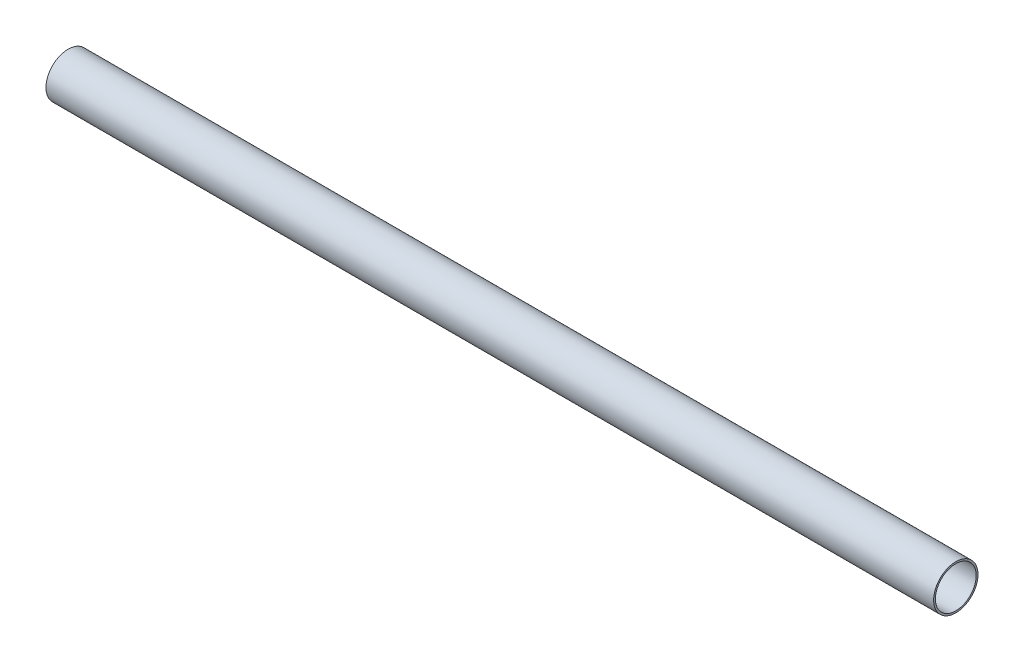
ISO-10303-21;
HEADER;
FILE_DESCRIPTION(('STEP AP214'),'2;1');
FILE_NAME('part.step','',(''),(''),'','','');
FILE_SCHEMA(('AUTOMOTIVE_DESIGN { 1 0 10303 214 1 1 1 1 }'));
ENDSEC;
DATA;
#1=APPLICATION_CONTEXT('core data for automotive mechanical design processes');
#2=APPLICATION_PROTOCOL_DEFINITION('international standard','automotive_design',2000,#1);
#3=PRODUCT_CONTEXT('',#1,'mechanical');
#4=PRODUCT('Part','Part','',(#3));
#5=PRODUCT_RELATED_PRODUCT_CATEGORY('part','',(#4));
#6=PRODUCT_DEFINITION_FORMATION('','',#4);
#7=PRODUCT_DEFINITION_CONTEXT('part definition',#1,'design');
#8=PRODUCT_DEFINITION('design','',#6,#7);
#9=PRODUCT_DEFINITION_SHAPE('','',#8);
#10=(LENGTH_UNIT() NAMED_UNIT(*) SI_UNIT(.MILLI.,.METRE.));
#11=(NAMED_UNIT(*) PLANE_ANGLE_UNIT() SI_UNIT($,.RADIAN.));
#12=(NAMED_UNIT(*) SI_UNIT($,.STERADIAN.) SOLID_ANGLE_UNIT());
#13=UNCERTAINTY_MEASURE_WITH_UNIT(LENGTH_MEASURE(1.E-05),#10,'distance_accuracy_value','');
#14=(GEOMETRIC_REPRESENTATION_CONTEXT(3) GLOBAL_UNCERTAINTY_ASSIGNED_CONTEXT((#13)) GLOBAL_UNIT_ASSIGNED_CONTEXT((#10,
#11,#12)) REPRESENTATION_CONTEXT('',''));
#15=CARTESIAN_POINT('',(0.,0.,0.));
#16=DIRECTION('',(0.,0.,1.));
#17=DIRECTION('',(1.,0.,0.));
#18=AXIS2_PLACEMENT_3D('',#15,#16,#17);
#19=CARTESIAN_POINT('',(1000.,0.,0.));
#20=DIRECTION('',(-1.,0.,0.));
#21=DIRECTION('',(0.,0.,1.));
#22=AXIS2_PLACEMENT_3D('',#19,#20,#21);
#23=CYLINDRICAL_SURFACE('',#22,23.);
#24=CARTESIAN_POINT('',(1000.,0.,0.));
#25=DIRECTION('',(1.,0.,0.));
#26=DIRECTION('',(0.,0.,-1.));
#27=AXIS2_PLACEMENT_3D('',#24,#25,#26);
#28=CIRCLE('',#27,23.);
#29=CARTESIAN_POINT('',(1000.,0.,-23.));
#30=VERTEX_POINT('',#29);
#31=EDGE_CURVE('E57',#30,#30,#28,.T.);
#32=ORIENTED_EDGE('',*,*,#31,.T.);
#33=EDGE_LOOP('',(#32));
#34=FACE_BOUND('',#33,.T.);
#35=CARTESIAN_POINT('',(0.,0.,0.));
#36=DIRECTION('',(1.,0.,0.));
#37=DIRECTION('',(0.,0.,-1.));
#38=AXIS2_PLACEMENT_3D('',#35,#36,#37);
#39=CIRCLE('',#38,23.);
#40=CARTESIAN_POINT('',(0.,0.,-23.));
#41=VERTEX_POINT('',#40);
#42=EDGE_CURVE('E63',#41,#41,#39,.T.);
#43=ORIENTED_EDGE('',*,*,#42,.F.);
#44=EDGE_LOOP('',(#43));
#45=FACE_BOUND('',#44,.T.);
#46=ADVANCED_FACE('F50',(#34,#45),#23,.F.);
#47=CARTESIAN_POINT('',(1000.,0.,0.));
#48=DIRECTION('',(-1.,0.,0.));
#49=DIRECTION('',(0.,0.,1.));
#50=AXIS2_PLACEMENT_3D('',#47,#48,#49);
#51=CYLINDRICAL_SURFACE('',#50,25.);
#52=CARTESIAN_POINT('',(1000.,0.,0.));
#53=DIRECTION('',(1.,0.,0.));
#54=DIRECTION('',(0.,0.,-1.));
#55=AXIS2_PLACEMENT_3D('',#52,#53,#54);
#56=CIRCLE('',#55,25.);
#57=CARTESIAN_POINT('',(1000.,0.,-25.));
#58=VERTEX_POINT('',#57);
#59=EDGE_CURVE('E11',#58,#58,#56,.T.);
#60=ORIENTED_EDGE('',*,*,#59,.F.);
#61=EDGE_LOOP('',(#60));
#62=FACE_BOUND('',#61,.T.);
#63=CARTESIAN_POINT('',(0.,0.,0.));
#64=DIRECTION('',(1.,0.,0.));
#65=DIRECTION('',(0.,0.,-1.));
#66=AXIS2_PLACEMENT_3D('',#63,#64,#65);
#67=CIRCLE('',#66,25.);
#68=CARTESIAN_POINT('',(0.,0.,-25.));
#69=VERTEX_POINT('',#68);
#70=EDGE_CURVE('E53',#69,#69,#67,.T.);
#71=ORIENTED_EDGE('',*,*,#70,.T.);
#72=EDGE_LOOP('',(#71));
#73=FACE_BOUND('',#72,.T.);
#74=ADVANCED_FACE('F70',(#62,#73),#51,.T.);
#75=CARTESIAN_POINT('',(1000.,0.,0.));
#76=DIRECTION('',(1.,0.,0.));
#77=DIRECTION('',(0.,0.,-1.));
#78=AXIS2_PLACEMENT_3D('',#75,#76,#77);
#79=PLANE('',#78);
#80=ORIENTED_EDGE('',*,*,#31,.F.);
#81=EDGE_LOOP('',(#80));
#82=FACE_BOUND('',#81,.T.);
#83=ORIENTED_EDGE('',*,*,#59,.T.);
#84=EDGE_LOOP('',(#83));
#85=FACE_BOUND('',#84,.T.);
#86=ADVANCED_FACE('F74',(#82,#85),#79,.T.);
#87=CARTESIAN_POINT('',(0.,0.,0.));
#88=DIRECTION('',(1.,0.,0.));
#89=DIRECTION('',(0.,0.,-1.));
#90=AXIS2_PLACEMENT_3D('',#87,#88,#89);
#91=PLANE('',#90);
#92=ORIENTED_EDGE('',*,*,#42,.T.);
#93=EDGE_LOOP('',(#92));
#94=FACE_BOUND('',#93,.T.);
#95=ORIENTED_EDGE('',*,*,#70,.F.);
#96=EDGE_LOOP('',(#95));
#97=FACE_BOUND('',#96,.T.);
#98=ADVANCED_FACE('F72',(#94,#97),#91,.F.);
#99=CLOSED_SHELL('',(#46,#74,#86,#98));
#100=MANIFOLD_SOLID_BREP('B2',#99);
#101=ADVANCED_BREP_SHAPE_REPRESENTATION('',(#18,#100),#14);
#102=SHAPE_DEFINITION_REPRESENTATION(#9,#101);
ENDSEC;
END-ISO-10303-21;
